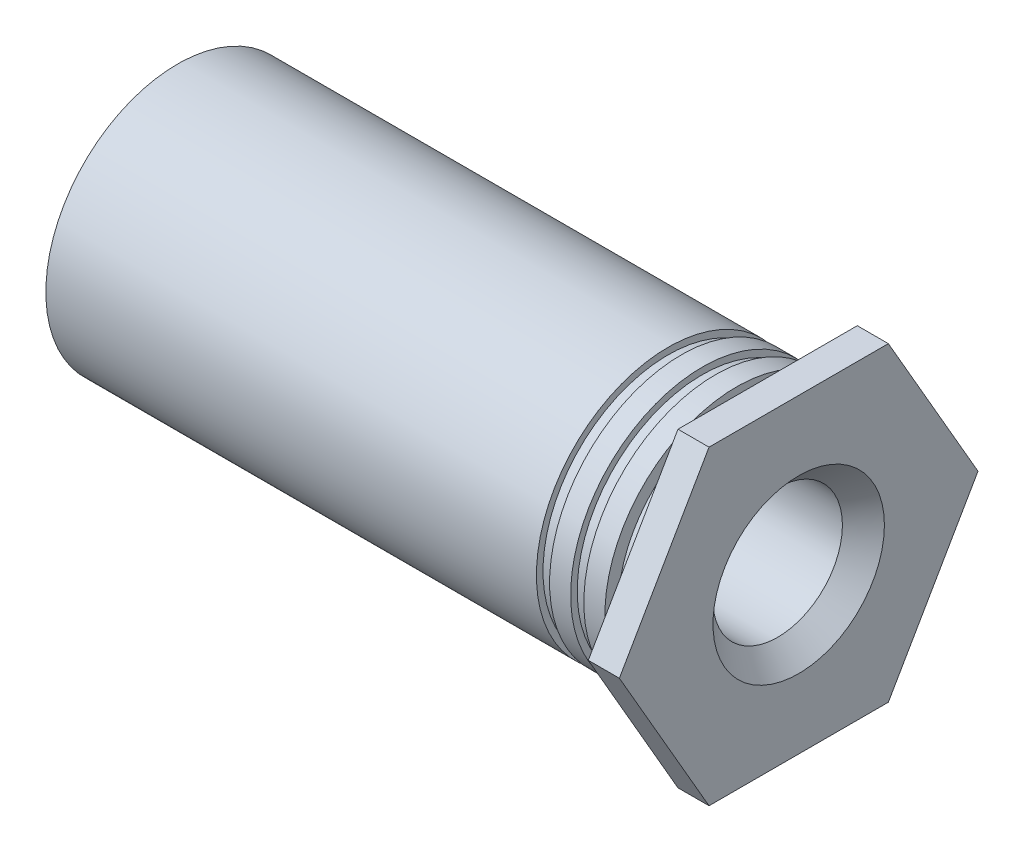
ISO-10303-21;
HEADER;
FILE_DESCRIPTION(('STEP AP214'),'2;1');
FILE_NAME('part.step','',(''),(''),'','','');
FILE_SCHEMA(('AUTOMOTIVE_DESIGN { 1 0 10303 214 1 1 1 1 }'));
ENDSEC;
DATA;
#1=APPLICATION_CONTEXT('core data for automotive mechanical design processes');
#2=APPLICATION_PROTOCOL_DEFINITION('international standard','automotive_design',2000,#1);
#3=PRODUCT_CONTEXT('',#1,'mechanical');
#4=PRODUCT('Part','Part','',(#3));
#5=PRODUCT_RELATED_PRODUCT_CATEGORY('part','',(#4));
#6=PRODUCT_DEFINITION_FORMATION('','',#4);
#7=PRODUCT_DEFINITION_CONTEXT('part definition',#1,'design');
#8=PRODUCT_DEFINITION('design','',#6,#7);
#9=PRODUCT_DEFINITION_SHAPE('','',#8);
#10=(LENGTH_UNIT() NAMED_UNIT(*) SI_UNIT(.MILLI.,.METRE.));
#11=(NAMED_UNIT(*) PLANE_ANGLE_UNIT() SI_UNIT($,.RADIAN.));
#12=(NAMED_UNIT(*) SI_UNIT($,.STERADIAN.) SOLID_ANGLE_UNIT());
#13=UNCERTAINTY_MEASURE_WITH_UNIT(LENGTH_MEASURE(1.E-05),#10,'distance_accuracy_value','');
#14=(GEOMETRIC_REPRESENTATION_CONTEXT(3) GLOBAL_UNCERTAINTY_ASSIGNED_CONTEXT((#13)) GLOBAL_UNIT_ASSIGNED_CONTEXT((#10,
#11,#12)) REPRESENTATION_CONTEXT('',''));
#15=CARTESIAN_POINT('',(0.,0.,0.));
#16=DIRECTION('',(0.,0.,1.));
#17=DIRECTION('',(1.,0.,0.));
#18=AXIS2_PLACEMENT_3D('',#15,#16,#17);
#19=CARTESIAN_POINT('',(-0.3175,0.,0.));
#20=DIRECTION('',(1.,0.,0.));
#21=DIRECTION('',(0.,0.,-1.));
#22=AXIS2_PLACEMENT_3D('',#19,#20,#21);
#23=CYLINDRICAL_SURFACE('',#22,2.42316);
#24=CARTESIAN_POINT('',(-0.635,0.,0.));
#25=DIRECTION('',(1.,0.,0.));
#26=DIRECTION('',(0.,0.,-1.));
#27=AXIS2_PLACEMENT_3D('',#24,#25,#26);
#28=CIRCLE('',#27,2.42316);
#29=CARTESIAN_POINT('',(-0.634999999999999,0.,-2.42316));
#30=VERTEX_POINT('',#29);
#31=EDGE_CURVE('E19',#30,#30,#28,.F.);
#32=ORIENTED_EDGE('',*,*,#31,.F.);
#33=EDGE_LOOP('',(#32));
#34=FACE_BOUND('',#33,.T.);
#35=CARTESIAN_POINT('',(0.,0.,0.));
#36=DIRECTION('',(1.,0.,0.));
#37=DIRECTION('',(0.,0.,-1.));
#38=AXIS2_PLACEMENT_3D('',#35,#36,#37);
#39=CIRCLE('',#38,2.42316);
#40=CARTESIAN_POINT('',(0.,0.,-2.42316));
#41=VERTEX_POINT('',#40);
#42=EDGE_CURVE('E135',#41,#41,#39,.F.);
#43=ORIENTED_EDGE('',*,*,#42,.T.);
#44=EDGE_LOOP('',(#43));
#45=FACE_BOUND('',#44,.T.);
#46=ADVANCED_FACE('F16',(#34,#45),#23,.T.);
#47=CARTESIAN_POINT('',(-0.635,0.,1.3462));
#48=DIRECTION('',(1.,0.,0.));
#49=DIRECTION('',(0.,0.,-1.));
#50=AXIS2_PLACEMENT_3D('',#47,#48,#49);
#51=PLANE('',#50);
#52=CARTESIAN_POINT('',(-0.635000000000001,0.,0.));
#53=DIRECTION('',(1.,0.,0.));
#54=DIRECTION('',(0.,0.,-1.));
#55=AXIS2_PLACEMENT_3D('',#52,#53,#54);
#56=CIRCLE('',#55,2.6924);
#57=CARTESIAN_POINT('',(-0.635,0.,-2.6924));
#58=VERTEX_POINT('',#57);
#59=EDGE_CURVE('E80',#58,#58,#56,.F.);
#60=ORIENTED_EDGE('',*,*,#59,.F.);
#61=EDGE_LOOP('',(#60));
#62=FACE_BOUND('',#61,.T.);
#63=ORIENTED_EDGE('',*,*,#31,.T.);
#64=EDGE_LOOP('',(#63));
#65=FACE_BOUND('',#64,.T.);
#66=ADVANCED_FACE('F142',(#62,#65),#51,.T.);
#67=CARTESIAN_POINT('',(0.,0.,0.));
#68=DIRECTION('',(1.,0.,0.));
#69=DIRECTION('',(0.,1.,0.));
#70=AXIS2_PLACEMENT_3D('',#67,#68,#69);
#71=PLANE('',#70);
#72=ORIENTED_EDGE('',*,*,#42,.F.);
#73=EDGE_LOOP('',(#72));
#74=FACE_BOUND('',#73,.T.);
#75=DIRECTION('',(0.,0.,1.));
#76=VECTOR('',#75,1.);
#77=CARTESIAN_POINT('',(0.,3.175,1.83308710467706));
#78=LINE('',#77,#76);
#79=CARTESIAN_POINT('',(0.,3.175,-1.83308710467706));
#80=VERTEX_POINT('',#79);
#81=CARTESIAN_POINT('',(0.,3.175,1.83308710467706));
#82=VERTEX_POINT('',#81);
#83=EDGE_CURVE('E71',#80,#82,#78,.T.);
#84=ORIENTED_EDGE('',*,*,#83,.F.);
#85=DIRECTION('',(0.,0.866025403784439,0.5));
#86=VECTOR('',#85,1.);
#87=CARTESIAN_POINT('',(0.,3.175,-1.83308710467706));
#88=LINE('',#87,#86);
#89=CARTESIAN_POINT('',(0.,0.,-3.66617420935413));
#90=VERTEX_POINT('',#89);
#91=EDGE_CURVE('E418',#90,#80,#88,.T.);
#92=ORIENTED_EDGE('',*,*,#91,.F.);
#93=DIRECTION('',(0.,0.866025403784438,-0.5));
#94=VECTOR('',#93,1.);
#95=CARTESIAN_POINT('',(0.,0.,-3.66617420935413));
#96=LINE('',#95,#94);
#97=CARTESIAN_POINT('',(0.,-3.175,-1.83308710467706));
#98=VERTEX_POINT('',#97);
#99=EDGE_CURVE('E406',#98,#90,#96,.T.);
#100=ORIENTED_EDGE('',*,*,#99,.F.);
#101=DIRECTION('',(0.,0.,-1.));
#102=VECTOR('',#101,1.);
#103=CARTESIAN_POINT('',(0.,-3.175,-1.83308710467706));
#104=LINE('',#103,#102);
#105=CARTESIAN_POINT('',(0.,-3.175,1.83308710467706));
#106=VERTEX_POINT('',#105);
#107=EDGE_CURVE('E405',#106,#98,#104,.T.);
#108=ORIENTED_EDGE('',*,*,#107,.F.);
#109=DIRECTION('',(0.,-0.866025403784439,-0.5));
#110=VECTOR('',#109,1.);
#111=CARTESIAN_POINT('',(0.,-3.175,1.83308710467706));
#112=LINE('',#111,#110);
#113=CARTESIAN_POINT('',(0.,0.,3.66617420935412));
#114=VERTEX_POINT('',#113);
#115=EDGE_CURVE('E84',#114,#106,#112,.T.);
#116=ORIENTED_EDGE('',*,*,#115,.F.);
#117=DIRECTION('',(0.,-0.866025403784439,0.5));
#118=VECTOR('',#117,1.);
#119=CARTESIAN_POINT('',(0.,0.,3.66617420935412));
#120=LINE('',#119,#118);
#121=EDGE_CURVE('E66',#82,#114,#120,.T.);
#122=ORIENTED_EDGE('',*,*,#121,.F.);
#123=EDGE_LOOP('',(#84,#92,#100,#108,#116,#122));
#124=FACE_BOUND('',#123,.T.);
#125=ADVANCED_FACE('F82',(#74,#124),#71,.F.);
#126=CARTESIAN_POINT('',(-6.35,0.,0.));
#127=DIRECTION('',(1.,0.,0.));
#128=DIRECTION('',(0.,0.,-1.));
#129=AXIS2_PLACEMENT_3D('',#126,#127,#128);
#130=CYLINDRICAL_SURFACE('',#129,2.6924);
#131=CARTESIAN_POINT('',(-1.065784,0.,0.));
#132=DIRECTION('',(1.,0.,0.));
#133=DIRECTION('',(0.,0.,-1.));
#134=AXIS2_PLACEMENT_3D('',#131,#132,#133);
#135=CIRCLE('',#134,2.6924);
#136=CARTESIAN_POINT('',(-1.065784,0.,-2.6924));
#137=VERTEX_POINT('',#136);
#138=EDGE_CURVE('E130',#137,#137,#135,.T.);
#139=ORIENTED_EDGE('',*,*,#138,.T.);
#140=EDGE_LOOP('',(#139));
#141=FACE_BOUND('',#140,.T.);
#142=ORIENTED_EDGE('',*,*,#59,.T.);
#143=EDGE_LOOP('',(#142));
#144=FACE_BOUND('',#143,.T.);
#145=ADVANCED_FACE('F233',(#141,#144),#130,.T.);
#146=CARTESIAN_POINT('',(0.,3.175,1.83308710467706));
#147=DIRECTION('',(0.,1.,0.));
#148=DIRECTION('',(0.,0.,1.));
#149=AXIS2_PLACEMENT_3D('',#146,#147,#148);
#150=PLANE('',#149);
#151=ORIENTED_EDGE('',*,*,#83,.T.);
#152=DIRECTION('',(1.,0.,0.));
#153=VECTOR('',#152,1.);
#154=CARTESIAN_POINT('',(0.,3.175,1.83308710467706));
#155=LINE('',#154,#153);
#156=CARTESIAN_POINT('',(0.635,3.175,1.83308710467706));
#157=VERTEX_POINT('',#156);
#158=EDGE_CURVE('E73',#157,#82,#155,.F.);
#159=ORIENTED_EDGE('',*,*,#158,.F.);
#160=DIRECTION('',(0.,0.,1.));
#161=VECTOR('',#160,1.);
#162=CARTESIAN_POINT('',(0.635,3.175,0.));
#163=LINE('',#162,#161);
#164=CARTESIAN_POINT('',(0.635,3.175,-1.83308710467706));
#165=VERTEX_POINT('',#164);
#166=EDGE_CURVE('E133',#165,#157,#163,.T.);
#167=ORIENTED_EDGE('',*,*,#166,.F.);
#168=DIRECTION('',(1.,0.,0.));
#169=VECTOR('',#168,1.);
#170=CARTESIAN_POINT('',(0.,3.175,-1.83308710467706));
#171=LINE('',#170,#169);
#172=EDGE_CURVE('E76',#80,#165,#171,.T.);
#173=ORIENTED_EDGE('',*,*,#172,.F.);
#174=EDGE_LOOP('',(#151,#159,#167,#173));
#175=FACE_BOUND('',#174,.T.);
#176=ADVANCED_FACE('F72',(#175),#150,.T.);
#177=CARTESIAN_POINT('',(0.,0.,3.66617420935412));
#178=DIRECTION('',(0.,0.5,0.866025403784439));
#179=DIRECTION('',(0.,-0.866025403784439,0.5));
#180=AXIS2_PLACEMENT_3D('',#177,#178,#179);
#181=PLANE('',#180);
#182=ORIENTED_EDGE('',*,*,#121,.T.);
#183=DIRECTION('',(1.,0.,0.));
#184=VECTOR('',#183,1.);
#185=CARTESIAN_POINT('',(0.,0.,3.66617420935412));
#186=LINE('',#185,#184);
#187=CARTESIAN_POINT('',(0.635,0.,3.66617420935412));
#188=VERTEX_POINT('',#187);
#189=EDGE_CURVE('E86',#188,#114,#186,.F.);
#190=ORIENTED_EDGE('',*,*,#189,.F.);
#191=DIRECTION('',(0.,-0.866025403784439,0.5));
#192=VECTOR('',#191,1.);
#193=CARTESIAN_POINT('',(0.635,3.175,1.83308710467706));
#194=LINE('',#193,#192);
#195=EDGE_CURVE('E90',#157,#188,#194,.T.);
#196=ORIENTED_EDGE('',*,*,#195,.F.);
#197=ORIENTED_EDGE('',*,*,#158,.T.);
#198=EDGE_LOOP('',(#182,#190,#196,#197));
#199=FACE_BOUND('',#198,.T.);
#200=ADVANCED_FACE('F88',(#199),#181,.T.);
#201=CARTESIAN_POINT('',(0.,-3.175,1.83308710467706));
#202=DIRECTION('',(0.,-0.5,0.866025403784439));
#203=DIRECTION('',(0.,-0.866025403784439,-0.5));
#204=AXIS2_PLACEMENT_3D('',#201,#202,#203);
#205=PLANE('',#204);
#206=ORIENTED_EDGE('',*,*,#115,.T.);
#207=DIRECTION('',(1.,0.,0.));
#208=VECTOR('',#207,1.);
#209=CARTESIAN_POINT('',(0.,-3.175,1.83308710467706));
#210=LINE('',#209,#208);
#211=CARTESIAN_POINT('',(0.635,-3.175,1.83308710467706));
#212=VERTEX_POINT('',#211);
#213=EDGE_CURVE('E401',#212,#106,#210,.F.);
#214=ORIENTED_EDGE('',*,*,#213,.F.);
#215=DIRECTION('',(0.,-0.866025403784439,-0.5));
#216=VECTOR('',#215,1.);
#217=CARTESIAN_POINT('',(0.635,0.,3.66617420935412));
#218=LINE('',#217,#216);
#219=EDGE_CURVE('E423',#188,#212,#218,.T.);
#220=ORIENTED_EDGE('',*,*,#219,.F.);
#221=ORIENTED_EDGE('',*,*,#189,.T.);
#222=EDGE_LOOP('',(#206,#214,#220,#221));
#223=FACE_BOUND('',#222,.T.);
#224=ADVANCED_FACE('F224',(#223),#205,.T.);
#225=CARTESIAN_POINT('',(0.,-3.175,-1.83308710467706));
#226=DIRECTION('',(0.,-1.,0.));
#227=DIRECTION('',(0.,0.,-1.));
#228=AXIS2_PLACEMENT_3D('',#225,#226,#227);
#229=PLANE('',#228);
#230=ORIENTED_EDGE('',*,*,#107,.T.);
#231=DIRECTION('',(1.,0.,0.));
#232=VECTOR('',#231,1.);
#233=CARTESIAN_POINT('',(0.,-3.175,-1.83308710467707));
#234=LINE('',#233,#232);
#235=CARTESIAN_POINT('',(0.635,-3.175,-1.83308710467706));
#236=VERTEX_POINT('',#235);
#237=EDGE_CURVE('E408',#236,#98,#234,.F.);
#238=ORIENTED_EDGE('',*,*,#237,.F.);
#239=DIRECTION('',(0.,0.,1.));
#240=VECTOR('',#239,1.);
#241=CARTESIAN_POINT('',(0.635,-3.175,0.));
#242=LINE('',#241,#240);
#243=EDGE_CURVE('E411',#212,#236,#242,.F.);
#244=ORIENTED_EDGE('',*,*,#243,.F.);
#245=ORIENTED_EDGE('',*,*,#213,.T.);
#246=EDGE_LOOP('',(#230,#238,#244,#245));
#247=FACE_BOUND('',#246,.T.);
#248=ADVANCED_FACE('F221',(#247),#229,.T.);
#249=CARTESIAN_POINT('',(0.,0.,-3.66617420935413));
#250=DIRECTION('',(0.,-0.5,-0.866025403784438));
#251=DIRECTION('',(0.,0.866025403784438,-0.5));
#252=AXIS2_PLACEMENT_3D('',#249,#250,#251);
#253=PLANE('',#252);
#254=ORIENTED_EDGE('',*,*,#99,.T.);
#255=DIRECTION('',(1.,0.,0.));
#256=VECTOR('',#255,1.);
#257=CARTESIAN_POINT('',(0.,0.,-3.66617420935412));
#258=LINE('',#257,#256);
#259=CARTESIAN_POINT('',(0.635,0.,-3.66617420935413));
#260=VERTEX_POINT('',#259);
#261=EDGE_CURVE('E34',#260,#90,#258,.F.);
#262=ORIENTED_EDGE('',*,*,#261,.F.);
#263=DIRECTION('',(0.,0.866025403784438,-0.500000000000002));
#264=VECTOR('',#263,1.);
#265=CARTESIAN_POINT('',(0.635,-3.175,-1.83308710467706));
#266=LINE('',#265,#264);
#267=EDGE_CURVE('E426',#236,#260,#266,.T.);
#268=ORIENTED_EDGE('',*,*,#267,.F.);
#269=ORIENTED_EDGE('',*,*,#237,.T.);
#270=EDGE_LOOP('',(#254,#262,#268,#269));
#271=FACE_BOUND('',#270,.T.);
#272=ADVANCED_FACE('F217',(#271),#253,.T.);
#273=CARTESIAN_POINT('',(0.,3.175,-1.83308710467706));
#274=DIRECTION('',(0.,0.5,-0.866025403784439));
#275=DIRECTION('',(0.,0.866025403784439,0.5));
#276=AXIS2_PLACEMENT_3D('',#273,#274,#275);
#277=PLANE('',#276);
#278=ORIENTED_EDGE('',*,*,#91,.T.);
#279=ORIENTED_EDGE('',*,*,#172,.T.);
#280=DIRECTION('',(0.,0.866025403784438,0.500000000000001));
#281=VECTOR('',#280,1.);
#282=CARTESIAN_POINT('',(0.635,0.,-3.66617420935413));
#283=LINE('',#282,#281);
#284=EDGE_CURVE('E129',#260,#165,#283,.T.);
#285=ORIENTED_EDGE('',*,*,#284,.F.);
#286=ORIENTED_EDGE('',*,*,#261,.T.);
#287=EDGE_LOOP('',(#278,#279,#285,#286));
#288=FACE_BOUND('',#287,.T.);
#289=ADVANCED_FACE('F213',(#288),#277,.T.);
#290=CARTESIAN_POINT('',(-1.065784,0.,2.62509));
#291=DIRECTION('',(1.,0.,0.));
#292=DIRECTION('',(0.,0.,-1.));
#293=AXIS2_PLACEMENT_3D('',#290,#291,#292);
#294=PLANE('',#293);
#295=ORIENTED_EDGE('',*,*,#138,.F.);
#296=EDGE_LOOP('',(#295));
#297=FACE_BOUND('',#296,.T.);
#298=CARTESIAN_POINT('',(-1.065784,0.,0.));
#299=DIRECTION('',(1.,0.,0.));
#300=DIRECTION('',(0.,0.,-1.));
#301=AXIS2_PLACEMENT_3D('',#298,#299,#300);
#302=CIRCLE('',#301,2.55778);
#303=CARTESIAN_POINT('',(-1.065784,0.,-2.55778));
#304=VERTEX_POINT('',#303);
#305=EDGE_CURVE('E126',#304,#304,#302,.F.);
#306=ORIENTED_EDGE('',*,*,#305,.F.);
#307=EDGE_LOOP('',(#306));
#308=FACE_BOUND('',#307,.T.);
#309=ADVANCED_FACE('F209',(#297,#308),#294,.F.);
#310=CARTESIAN_POINT('',(0.635,0.,0.));
#311=DIRECTION('',(1.,0.,0.));
#312=DIRECTION('',(0.,1.,0.));
#313=AXIS2_PLACEMENT_3D('',#310,#311,#312);
#314=PLANE('',#313);
#315=ORIENTED_EDGE('',*,*,#267,.T.);
#316=ORIENTED_EDGE('',*,*,#284,.T.);
#317=ORIENTED_EDGE('',*,*,#166,.T.);
#318=ORIENTED_EDGE('',*,*,#195,.T.);
#319=ORIENTED_EDGE('',*,*,#219,.T.);
#320=ORIENTED_EDGE('',*,*,#243,.T.);
#321=EDGE_LOOP('',(#315,#316,#317,#318,#319,#320));
#322=FACE_BOUND('',#321,.T.);
#323=CARTESIAN_POINT('',(0.634999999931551,0.,0.));
#324=DIRECTION('',(1.,0.,0.));
#325=DIRECTION('',(0.,0.,-1.));
#326=AXIS2_PLACEMENT_3D('',#323,#324,#325);
#327=CIRCLE('',#326,1.75259999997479);
#328=CARTESIAN_POINT('',(0.634999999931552,0.,-1.75259999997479));
#329=VERTEX_POINT('',#328);
#330=EDGE_CURVE('E123',#329,#329,#327,.F.);
#331=ORIENTED_EDGE('',*,*,#330,.T.);
#332=EDGE_LOOP('',(#331));
#333=FACE_BOUND('',#332,.T.);
#334=ADVANCED_FACE('F205',(#322,#333),#314,.T.);
#335=CARTESIAN_POINT('',(-1.200404,0.,0.));
#336=DIRECTION('',(1.,0.,0.));
#337=DIRECTION('',(0.,0.,-1.));
#338=AXIS2_PLACEMENT_3D('',#335,#336,#337);
#339=CYLINDRICAL_SURFACE('',#338,2.55778);
#340=CARTESIAN_POINT('',(-1.335024,0.,0.));
#341=DIRECTION('',(1.,0.,0.));
#342=DIRECTION('',(0.,0.,-1.));
#343=AXIS2_PLACEMENT_3D('',#340,#341,#342);
#344=CIRCLE('',#343,2.55778);
#345=CARTESIAN_POINT('',(-1.335024,0.,-2.55778));
#346=VERTEX_POINT('',#345);
#347=EDGE_CURVE('E120',#346,#346,#344,.T.);
#348=ORIENTED_EDGE('',*,*,#347,.T.);
#349=EDGE_LOOP('',(#348));
#350=FACE_BOUND('',#349,.T.);
#351=ORIENTED_EDGE('',*,*,#305,.T.);
#352=EDGE_LOOP('',(#351));
#353=FACE_BOUND('',#352,.T.);
#354=ADVANCED_FACE('F201',(#350,#353),#339,.T.);
#355=CARTESIAN_POINT('',(0.634999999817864,0.,0.));
#356=DIRECTION('',(1.,0.,0.));
#357=DIRECTION('',(0.,0.,-1.));
#358=AXIS2_PLACEMENT_3D('',#355,#356,#357);
#359=CONICAL_SURFACE('',#358,1.7525999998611,0.785398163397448);
#360=CARTESIAN_POINT('',(0.205740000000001,0.,0.));
#361=DIRECTION('',(1.,0.,0.));
#362=DIRECTION('',(0.,0.,-1.));
#363=AXIS2_PLACEMENT_3D('',#360,#361,#362);
#364=CIRCLE('',#363,1.32334);
#365=CARTESIAN_POINT('',(0.205740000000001,0.,-1.32334));
#366=VERTEX_POINT('',#365);
#367=EDGE_CURVE('E119',#366,#366,#364,.F.);
#368=ORIENTED_EDGE('',*,*,#367,.T.);
#369=EDGE_LOOP('',(#368));
#370=FACE_BOUND('',#369,.T.);
#371=ORIENTED_EDGE('',*,*,#330,.F.);
#372=EDGE_LOOP('',(#371));
#373=FACE_BOUND('',#372,.T.);
#374=ADVANCED_FACE('F197',(#370,#373),#359,.F.);
#375=CARTESIAN_POINT('',(-1.335024,0.,2.62509));
#376=DIRECTION('',(-1.,0.,0.));
#377=DIRECTION('',(0.,0.,1.));
#378=AXIS2_PLACEMENT_3D('',#375,#376,#377);
#379=PLANE('',#378);
#380=ORIENTED_EDGE('',*,*,#347,.F.);
#381=EDGE_LOOP('',(#380));
#382=FACE_BOUND('',#381,.T.);
#383=CARTESIAN_POINT('',(-1.335024,0.,0.));
#384=DIRECTION('',(1.,0.,0.));
#385=DIRECTION('',(0.,0.,-1.));
#386=AXIS2_PLACEMENT_3D('',#383,#384,#385);
#387=CIRCLE('',#386,2.6924);
#388=CARTESIAN_POINT('',(-1.335024,0.,-2.6924));
#389=VERTEX_POINT('',#388);
#390=EDGE_CURVE('E116',#389,#389,#387,.F.);
#391=ORIENTED_EDGE('',*,*,#390,.F.);
#392=EDGE_LOOP('',(#391));
#393=FACE_BOUND('',#392,.T.);
#394=ADVANCED_FACE('F193',(#382,#393),#379,.F.);
#395=CARTESIAN_POINT('',(-3.3401,0.,0.));
#396=DIRECTION('',(1.,0.,0.));
#397=DIRECTION('',(0.,0.,-1.));
#398=AXIS2_PLACEMENT_3D('',#395,#396,#397);
#399=CYLINDRICAL_SURFACE('',#398,1.32334);
#400=CARTESIAN_POINT('',(-6.88593999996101,0.,0.));
#401=DIRECTION('',(-1.,0.,0.));
#402=DIRECTION('',(0.,0.,-1.));
#403=AXIS2_PLACEMENT_3D('',#400,#401,#402);
#404=CIRCLE('',#403,1.32334000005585);
#405=CARTESIAN_POINT('',(-6.88593999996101,0.,-1.32334000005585));
#406=VERTEX_POINT('',#405);
#407=EDGE_CURVE('E115',#406,#406,#404,.T.);
#408=ORIENTED_EDGE('',*,*,#407,.T.);
#409=EDGE_LOOP('',(#408));
#410=FACE_BOUND('',#409,.T.);
#411=ORIENTED_EDGE('',*,*,#367,.F.);
#412=EDGE_LOOP('',(#411));
#413=FACE_BOUND('',#412,.T.);
#414=ADVANCED_FACE('F189',(#410,#413),#399,.F.);
#415=CARTESIAN_POINT('',(-6.35,0.,0.));
#416=DIRECTION('',(1.,0.,0.));
#417=DIRECTION('',(0.,0.,-1.));
#418=AXIS2_PLACEMENT_3D('',#415,#416,#417);
#419=CYLINDRICAL_SURFACE('',#418,2.6924);
#420=CARTESIAN_POINT('',(-1.765808,0.,0.));
#421=DIRECTION('',(1.,0.,0.));
#422=DIRECTION('',(0.,0.,-1.));
#423=AXIS2_PLACEMENT_3D('',#420,#421,#422);
#424=CIRCLE('',#423,2.6924);
#425=CARTESIAN_POINT('',(-1.765808,0.,-2.6924));
#426=VERTEX_POINT('',#425);
#427=EDGE_CURVE('E112',#426,#426,#424,.T.);
#428=ORIENTED_EDGE('',*,*,#427,.T.);
#429=EDGE_LOOP('',(#428));
#430=FACE_BOUND('',#429,.T.);
#431=ORIENTED_EDGE('',*,*,#390,.T.);
#432=EDGE_LOOP('',(#431));
#433=FACE_BOUND('',#432,.T.);
#434=ADVANCED_FACE('F185',(#430,#433),#419,.T.);
#435=CARTESIAN_POINT('',(-7.3151999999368,0.,0.));
#436=DIRECTION('',(-1.,0.,0.));
#437=DIRECTION('',(0.,0.,1.));
#438=AXIS2_PLACEMENT_3D('',#435,#436,#437);
#439=CONICAL_SURFACE('',#438,1.75259999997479,0.785398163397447);
#440=CARTESIAN_POINT('',(-7.31519999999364,0.,0.));
#441=DIRECTION('',(-1.,0.,0.));
#442=DIRECTION('',(0.,0.,1.));
#443=AXIS2_PLACEMENT_3D('',#440,#441,#442);
#444=CIRCLE('',#443,1.75260000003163);
#445=CARTESIAN_POINT('',(-7.31519999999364,0.,1.75260000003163));
#446=VERTEX_POINT('',#445);
#447=EDGE_CURVE('E109',#446,#446,#444,.T.);
#448=ORIENTED_EDGE('',*,*,#447,.T.);
#449=EDGE_LOOP('',(#448));
#450=FACE_BOUND('',#449,.T.);
#451=ORIENTED_EDGE('',*,*,#407,.F.);
#452=EDGE_LOOP('',(#451));
#453=FACE_BOUND('',#452,.T.);
#454=ADVANCED_FACE('F181',(#450,#453),#439,.F.);
#455=CARTESIAN_POINT('',(-1.765808,0.,2.62509));
#456=DIRECTION('',(1.,0.,0.));
#457=DIRECTION('',(0.,0.,-1.));
#458=AXIS2_PLACEMENT_3D('',#455,#456,#457);
#459=PLANE('',#458);
#460=ORIENTED_EDGE('',*,*,#427,.F.);
#461=EDGE_LOOP('',(#460));
#462=FACE_BOUND('',#461,.T.);
#463=CARTESIAN_POINT('',(-1.765808,0.,0.));
#464=DIRECTION('',(1.,0.,0.));
#465=DIRECTION('',(0.,0.,-1.));
#466=AXIS2_PLACEMENT_3D('',#463,#464,#465);
#467=CIRCLE('',#466,2.55778);
#468=CARTESIAN_POINT('',(-1.765808,0.,-2.55778));
#469=VERTEX_POINT('',#468);
#470=EDGE_CURVE('E106',#469,#469,#467,.F.);
#471=ORIENTED_EDGE('',*,*,#470,.F.);
#472=EDGE_LOOP('',(#471));
#473=FACE_BOUND('',#472,.T.);
#474=ADVANCED_FACE('F177',(#462,#473),#459,.F.);
#475=CARTESIAN_POINT('',(-7.3152,0.,-0.9906));
#476=DIRECTION('',(1.,0.,0.));
#477=DIRECTION('',(0.,0.,-1.));
#478=AXIS2_PLACEMENT_3D('',#475,#476,#477);
#479=PLANE('',#478);
#480=CARTESIAN_POINT('',(-7.3152,0.,0.));
#481=DIRECTION('',(-1.,0.,0.));
#482=DIRECTION('',(0.,0.,1.));
#483=AXIS2_PLACEMENT_3D('',#480,#481,#482);
#484=CIRCLE('',#483,1.9812);
#485=CARTESIAN_POINT('',(-7.3152,0.,1.9812));
#486=VERTEX_POINT('',#485);
#487=EDGE_CURVE('E103',#486,#486,#484,.T.);
#488=ORIENTED_EDGE('',*,*,#487,.T.);
#489=EDGE_LOOP('',(#488));
#490=FACE_BOUND('',#489,.T.);
#491=ORIENTED_EDGE('',*,*,#447,.F.);
#492=EDGE_LOOP('',(#491));
#493=FACE_BOUND('',#492,.T.);
#494=ADVANCED_FACE('F173',(#490,#493),#479,.F.);
#495=CARTESIAN_POINT('',(-1.900428,0.,0.));
#496=DIRECTION('',(1.,0.,0.));
#497=DIRECTION('',(0.,0.,-1.));
#498=AXIS2_PLACEMENT_3D('',#495,#496,#497);
#499=CYLINDRICAL_SURFACE('',#498,2.55778);
#500=CARTESIAN_POINT('',(-2.035048,0.,0.));
#501=DIRECTION('',(1.,0.,0.));
#502=DIRECTION('',(0.,0.,-1.));
#503=AXIS2_PLACEMENT_3D('',#500,#501,#502);
#504=CIRCLE('',#503,2.55778);
#505=CARTESIAN_POINT('',(-2.035048,0.,-2.55778));
#506=VERTEX_POINT('',#505);
#507=EDGE_CURVE('E100',#506,#506,#504,.T.);
#508=ORIENTED_EDGE('',*,*,#507,.T.);
#509=EDGE_LOOP('',(#508));
#510=FACE_BOUND('',#509,.T.);
#511=ORIENTED_EDGE('',*,*,#470,.T.);
#512=EDGE_LOOP('',(#511));
#513=FACE_BOUND('',#512,.T.);
#514=ADVANCED_FACE('F169',(#510,#513),#499,.T.);
#515=CARTESIAN_POINT('',(-9.6901,0.,0.));
#516=DIRECTION('',(-1.,0.,0.));
#517=DIRECTION('',(0.,0.,1.));
#518=AXIS2_PLACEMENT_3D('',#515,#516,#517);
#519=CYLINDRICAL_SURFACE('',#518,1.9812);
#520=CARTESIAN_POINT('',(-12.065,0.,0.));
#521=DIRECTION('',(-1.,0.,0.));
#522=DIRECTION('',(0.,0.,1.));
#523=AXIS2_PLACEMENT_3D('',#520,#521,#522);
#524=CIRCLE('',#523,1.9812);
#525=CARTESIAN_POINT('',(-12.065,0.,1.9812));
#526=VERTEX_POINT('',#525);
#527=EDGE_CURVE('E97',#526,#526,#524,.F.);
#528=ORIENTED_EDGE('',*,*,#527,.F.);
#529=EDGE_LOOP('',(#528));
#530=FACE_BOUND('',#529,.T.);
#531=ORIENTED_EDGE('',*,*,#487,.F.);
#532=EDGE_LOOP('',(#531));
#533=FACE_BOUND('',#532,.T.);
#534=ADVANCED_FACE('F165',(#530,#533),#519,.F.);
#535=CARTESIAN_POINT('',(-2.035048,0.,2.62509));
#536=DIRECTION('',(-1.,0.,0.));
#537=DIRECTION('',(0.,0.,1.));
#538=AXIS2_PLACEMENT_3D('',#535,#536,#537);
#539=PLANE('',#538);
#540=ORIENTED_EDGE('',*,*,#507,.F.);
#541=EDGE_LOOP('',(#540));
#542=FACE_BOUND('',#541,.T.);
#543=CARTESIAN_POINT('',(-2.035048,0.,0.));
#544=DIRECTION('',(1.,0.,0.));
#545=DIRECTION('',(0.,0.,-1.));
#546=AXIS2_PLACEMENT_3D('',#543,#544,#545);
#547=CIRCLE('',#546,2.6924);
#548=CARTESIAN_POINT('',(-2.035048,0.,-2.6924));
#549=VERTEX_POINT('',#548);
#550=EDGE_CURVE('E25',#549,#549,#547,.F.);
#551=ORIENTED_EDGE('',*,*,#550,.F.);
#552=EDGE_LOOP('',(#551));
#553=FACE_BOUND('',#552,.T.);
#554=ADVANCED_FACE('F158',(#542,#553),#539,.F.);
#555=CARTESIAN_POINT('',(-12.065,0.,1.3462));
#556=DIRECTION('',(-1.,0.,0.));
#557=DIRECTION('',(0.,0.,1.));
#558=AXIS2_PLACEMENT_3D('',#555,#556,#557);
#559=PLANE('',#558);
#560=CARTESIAN_POINT('',(-12.065,0.,0.));
#561=DIRECTION('',(1.,0.,0.));
#562=DIRECTION('',(0.,0.,-1.));
#563=AXIS2_PLACEMENT_3D('',#560,#561,#562);
#564=CIRCLE('',#563,2.6924);
#565=CARTESIAN_POINT('',(-12.065,0.,-2.6924));
#566=VERTEX_POINT('',#565);
#567=EDGE_CURVE('E11',#566,#566,#564,.T.);
#568=ORIENTED_EDGE('',*,*,#567,.F.);
#569=EDGE_LOOP('',(#568));
#570=FACE_BOUND('',#569,.T.);
#571=ORIENTED_EDGE('',*,*,#527,.T.);
#572=EDGE_LOOP('',(#571));
#573=FACE_BOUND('',#572,.T.);
#574=ADVANCED_FACE('F152',(#570,#573),#559,.T.);
#575=CARTESIAN_POINT('',(-6.35,0.,0.));
#576=DIRECTION('',(1.,0.,0.));
#577=DIRECTION('',(0.,0.,-1.));
#578=AXIS2_PLACEMENT_3D('',#575,#576,#577);
#579=CYLINDRICAL_SURFACE('',#578,2.6924);
#580=ORIENTED_EDGE('',*,*,#550,.T.);
#581=EDGE_LOOP('',(#580));
#582=FACE_BOUND('',#581,.T.);
#583=ORIENTED_EDGE('',*,*,#567,.T.);
#584=EDGE_LOOP('',(#583));
#585=FACE_BOUND('',#584,.T.);
#586=ADVANCED_FACE('F150',(#582,#585),#579,.T.);
#587=CLOSED_SHELL('',(#46,#66,#125,#145,#176,#200,#224,#248,#272,#289,#309,#334,#354,#374,#394,
#414,#434,#454,#474,#494,#514,#534,#554,#574,#586));
#588=MANIFOLD_SOLID_BREP('B1',#587);
#589=ADVANCED_BREP_SHAPE_REPRESENTATION('',(#18,#588),#14);
#590=SHAPE_DEFINITION_REPRESENTATION(#9,#589);
ENDSEC;
END-ISO-10303-21;
